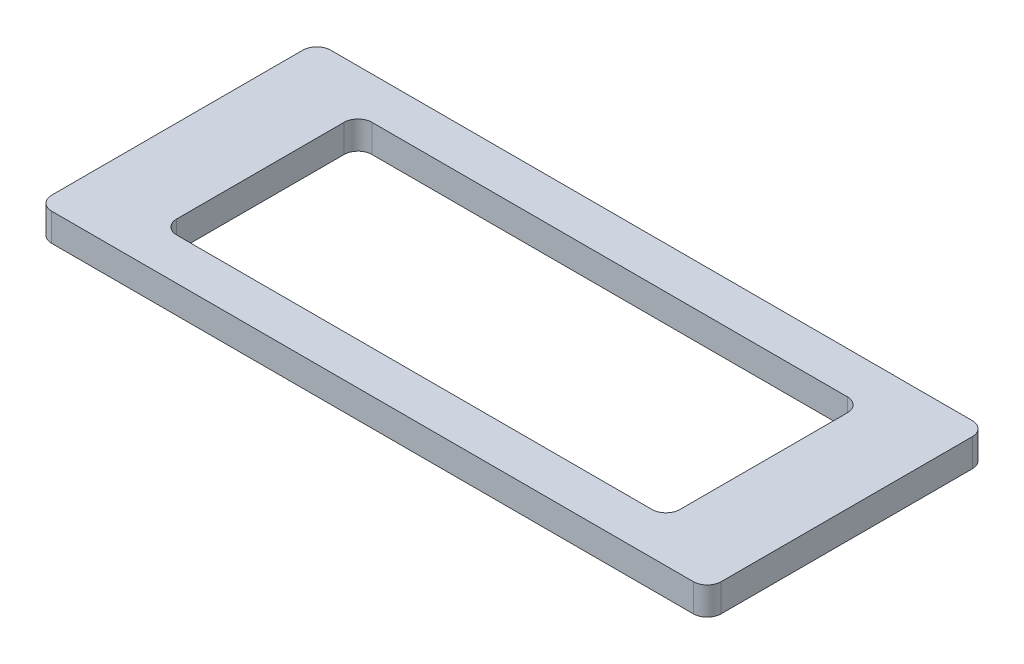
ISO-10303-21;
HEADER;
FILE_DESCRIPTION(('STEP AP214'),'2;1');
FILE_NAME('part.step','',(''),(''),'','','');
FILE_SCHEMA(('AUTOMOTIVE_DESIGN { 1 0 10303 214 1 1 1 1 }'));
ENDSEC;
DATA;
#1=APPLICATION_CONTEXT('core data for automotive mechanical design processes');
#2=APPLICATION_PROTOCOL_DEFINITION('international standard','automotive_design',2000,#1);
#3=PRODUCT_CONTEXT('',#1,'mechanical');
#4=PRODUCT('Part','Part','',(#3));
#5=PRODUCT_RELATED_PRODUCT_CATEGORY('part','',(#4));
#6=PRODUCT_DEFINITION_FORMATION('','',#4);
#7=PRODUCT_DEFINITION_CONTEXT('part definition',#1,'design');
#8=PRODUCT_DEFINITION('design','',#6,#7);
#9=PRODUCT_DEFINITION_SHAPE('','',#8);
#10=(LENGTH_UNIT() NAMED_UNIT(*) SI_UNIT(.MILLI.,.METRE.));
#11=(NAMED_UNIT(*) PLANE_ANGLE_UNIT() SI_UNIT($,.RADIAN.));
#12=(NAMED_UNIT(*) SI_UNIT($,.STERADIAN.) SOLID_ANGLE_UNIT());
#13=UNCERTAINTY_MEASURE_WITH_UNIT(LENGTH_MEASURE(1.E-05),#10,'distance_accuracy_value','');
#14=(GEOMETRIC_REPRESENTATION_CONTEXT(3) GLOBAL_UNCERTAINTY_ASSIGNED_CONTEXT((#13)) GLOBAL_UNIT_ASSIGNED_CONTEXT((#10,
#11,#12)) REPRESENTATION_CONTEXT('',''));
#15=CARTESIAN_POINT('',(0.,0.,0.));
#16=DIRECTION('',(0.,0.,1.));
#17=DIRECTION('',(1.,0.,0.));
#18=AXIS2_PLACEMENT_3D('',#15,#16,#17);
#19=CARTESIAN_POINT('',(-71.2820838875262,6.35,-53.975));
#20=DIRECTION('',(0.,0.,-1.));
#21=DIRECTION('',(-1.,0.,0.));
#22=AXIS2_PLACEMENT_3D('',#19,#20,#21);
#23=PLANE('',#22);
#24=DIRECTION('',(1.,0.,0.));
#25=VECTOR('',#24,1.);
#26=CARTESIAN_POINT('',(-71.2820838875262,0.,-53.975));
#27=LINE('',#26,#25);
#28=CARTESIAN_POINT('',(-15.748,0.,-53.975));
#29=VERTEX_POINT('',#28);
#30=CARTESIAN_POINT('',(130.302,0.,-53.975));
#31=VERTEX_POINT('',#30);
#32=EDGE_CURVE('E230',#29,#31,#27,.T.);
#33=ORIENTED_EDGE('',*,*,#32,.F.);
#34=DIRECTION('',(0.,-1.,0.));
#35=VECTOR('',#34,1.);
#36=CARTESIAN_POINT('',(-15.748,6.35,-53.975));
#37=LINE('',#36,#35);
#38=CARTESIAN_POINT('',(-15.748,6.35,-53.975));
#39=VERTEX_POINT('',#38);
#40=EDGE_CURVE('E11',#39,#29,#37,.T.);
#41=ORIENTED_EDGE('',*,*,#40,.F.);
#42=DIRECTION('',(1.,0.,0.));
#43=VECTOR('',#42,1.);
#44=CARTESIAN_POINT('',(-71.2820838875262,6.35,-53.975));
#45=LINE('',#44,#43);
#46=CARTESIAN_POINT('',(130.302,6.35,-53.975));
#47=VERTEX_POINT('',#46);
#48=EDGE_CURVE('E262',#39,#47,#45,.T.);
#49=ORIENTED_EDGE('',*,*,#48,.T.);
#50=DIRECTION('',(0.,-1.,0.));
#51=VECTOR('',#50,1.);
#52=CARTESIAN_POINT('',(130.302,6.35,-53.975));
#53=LINE('',#52,#51);
#54=EDGE_CURVE('E111',#47,#31,#53,.T.);
#55=ORIENTED_EDGE('',*,*,#54,.T.);
#56=EDGE_LOOP('',(#33,#41,#49,#55));
#57=FACE_BOUND('',#56,.T.);
#58=ADVANCED_FACE('F34',(#57),#23,.T.);
#59=CARTESIAN_POINT('',(-15.748,6.35,-50.8));
#60=DIRECTION('',(0.,-1.,0.));
#61=DIRECTION('',(0.,0.,-1.));
#62=AXIS2_PLACEMENT_3D('',#59,#60,#61);
#63=CYLINDRICAL_SURFACE('',#62,3.175);
#64=CARTESIAN_POINT('',(-15.748,0.,-50.8));
#65=DIRECTION('',(0.,1.,0.));
#66=DIRECTION('',(0.,0.,1.));
#67=AXIS2_PLACEMENT_3D('',#64,#65,#66);
#68=CIRCLE('',#67,3.175);
#69=CARTESIAN_POINT('',(-18.923,0.,-50.8));
#70=VERTEX_POINT('',#69);
#71=EDGE_CURVE('E227',#29,#70,#68,.T.);
#72=ORIENTED_EDGE('',*,*,#71,.T.);
#73=DIRECTION('',(0.,-1.,0.));
#74=VECTOR('',#73,1.);
#75=CARTESIAN_POINT('',(-18.923,6.35,-50.8));
#76=LINE('',#75,#74);
#77=CARTESIAN_POINT('',(-18.923,6.35,-50.8));
#78=VERTEX_POINT('',#77);
#79=EDGE_CURVE('E44',#78,#70,#76,.T.);
#80=ORIENTED_EDGE('',*,*,#79,.F.);
#81=CARTESIAN_POINT('',(-15.748,6.35,-50.8));
#82=DIRECTION('',(0.,1.,0.));
#83=DIRECTION('',(0.,0.,1.));
#84=AXIS2_PLACEMENT_3D('',#81,#82,#83);
#85=CIRCLE('',#84,3.175);
#86=EDGE_CURVE('E260',#39,#78,#85,.T.);
#87=ORIENTED_EDGE('',*,*,#86,.F.);
#88=ORIENTED_EDGE('',*,*,#40,.T.);
#89=EDGE_LOOP('',(#72,#80,#87,#88));
#90=FACE_BOUND('',#89,.T.);
#91=ADVANCED_FACE('F346',(#90),#63,.T.);
#92=CARTESIAN_POINT('',(-18.923,6.35,-22.225));
#93=DIRECTION('',(-1.,0.,0.));
#94=DIRECTION('',(0.,0.,1.));
#95=AXIS2_PLACEMENT_3D('',#92,#93,#94);
#96=PLANE('',#95);
#97=DIRECTION('',(0.,0.,-1.));
#98=VECTOR('',#97,1.);
#99=CARTESIAN_POINT('',(-18.923,0.,-22.225));
#100=LINE('',#99,#98);
#101=CARTESIAN_POINT('',(-18.923,0.,6.35));
#102=VERTEX_POINT('',#101);
#103=EDGE_CURVE('E224',#102,#70,#100,.T.);
#104=ORIENTED_EDGE('',*,*,#103,.F.);
#105=DIRECTION('',(0.,-1.,0.));
#106=VECTOR('',#105,1.);
#107=CARTESIAN_POINT('',(-18.923,6.35,6.35));
#108=LINE('',#107,#106);
#109=CARTESIAN_POINT('',(-18.923,6.35,6.35));
#110=VERTEX_POINT('',#109);
#111=EDGE_CURVE('E187',#110,#102,#108,.T.);
#112=ORIENTED_EDGE('',*,*,#111,.F.);
#113=DIRECTION('',(0.,0.,-1.));
#114=VECTOR('',#113,1.);
#115=CARTESIAN_POINT('',(-18.923,6.35,-22.225));
#116=LINE('',#115,#114);
#117=EDGE_CURVE('E257',#110,#78,#116,.T.);
#118=ORIENTED_EDGE('',*,*,#117,.T.);
#119=ORIENTED_EDGE('',*,*,#79,.T.);
#120=EDGE_LOOP('',(#104,#112,#118,#119));
#121=FACE_BOUND('',#120,.T.);
#122=ADVANCED_FACE('F352',(#121),#96,.T.);
#123=CARTESIAN_POINT('',(-15.748,6.35,6.35));
#124=DIRECTION('',(0.,-1.,0.));
#125=DIRECTION('',(0.,0.,-1.));
#126=AXIS2_PLACEMENT_3D('',#123,#124,#125);
#127=CYLINDRICAL_SURFACE('',#126,3.175);
#128=CARTESIAN_POINT('',(-15.748,0.,6.35));
#129=DIRECTION('',(0.,1.,0.));
#130=DIRECTION('',(0.,0.,1.));
#131=AXIS2_PLACEMENT_3D('',#128,#129,#130);
#132=CIRCLE('',#131,3.175);
#133=CARTESIAN_POINT('',(-15.748,0.,9.525));
#134=VERTEX_POINT('',#133);
#135=EDGE_CURVE('E221',#102,#134,#132,.T.);
#136=ORIENTED_EDGE('',*,*,#135,.T.);
#137=DIRECTION('',(0.,-1.,0.));
#138=VECTOR('',#137,1.);
#139=CARTESIAN_POINT('',(-15.748,6.35,9.525));
#140=LINE('',#139,#138);
#141=CARTESIAN_POINT('',(-15.748,6.35,9.525));
#142=VERTEX_POINT('',#141);
#143=EDGE_CURVE('E180',#142,#134,#140,.T.);
#144=ORIENTED_EDGE('',*,*,#143,.F.);
#145=CARTESIAN_POINT('',(-15.748,6.35,6.35));
#146=DIRECTION('',(0.,1.,0.));
#147=DIRECTION('',(0.,0.,1.));
#148=AXIS2_PLACEMENT_3D('',#145,#146,#147);
#149=CIRCLE('',#148,3.175);
#150=EDGE_CURVE('E255',#110,#142,#149,.T.);
#151=ORIENTED_EDGE('',*,*,#150,.F.);
#152=ORIENTED_EDGE('',*,*,#111,.T.);
#153=EDGE_LOOP('',(#136,#144,#151,#152));
#154=FACE_BOUND('',#153,.T.);
#155=ADVANCED_FACE('F355',(#154),#127,.T.);
#156=CARTESIAN_POINT('',(-71.2820838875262,6.35,9.525));
#157=DIRECTION('',(0.,0.,-1.));
#158=DIRECTION('',(-1.,0.,0.));
#159=AXIS2_PLACEMENT_3D('',#156,#157,#158);
#160=PLANE('',#159);
#161=DIRECTION('',(1.,0.,0.));
#162=VECTOR('',#161,1.);
#163=CARTESIAN_POINT('',(-71.2820838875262,0.,9.525));
#164=LINE('',#163,#162);
#165=CARTESIAN_POINT('',(130.302,0.,9.525));
#166=VERTEX_POINT('',#165);
#167=EDGE_CURVE('E218',#134,#166,#164,.T.);
#168=ORIENTED_EDGE('',*,*,#167,.T.);
#169=DIRECTION('',(0.,-1.,0.));
#170=VECTOR('',#169,1.);
#171=CARTESIAN_POINT('',(130.302,6.35,9.525));
#172=LINE('',#171,#170);
#173=CARTESIAN_POINT('',(130.302,6.35,9.525));
#174=VERTEX_POINT('',#173);
#175=EDGE_CURVE('E178',#174,#166,#172,.T.);
#176=ORIENTED_EDGE('',*,*,#175,.F.);
#177=DIRECTION('',(1.,0.,0.));
#178=VECTOR('',#177,1.);
#179=CARTESIAN_POINT('',(-71.2820838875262,6.35,9.525));
#180=LINE('',#179,#178);
#181=EDGE_CURVE('E171',#142,#174,#180,.T.);
#182=ORIENTED_EDGE('',*,*,#181,.F.);
#183=ORIENTED_EDGE('',*,*,#143,.T.);
#184=EDGE_LOOP('',(#168,#176,#182,#183));
#185=FACE_BOUND('',#184,.T.);
#186=ADVANCED_FACE('F357',(#185),#160,.F.);
#187=CARTESIAN_POINT('',(130.302,6.35,6.35));
#188=DIRECTION('',(0.,-1.,0.));
#189=DIRECTION('',(0.,0.,-1.));
#190=AXIS2_PLACEMENT_3D('',#187,#188,#189);
#191=CYLINDRICAL_SURFACE('',#190,3.17500000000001);
#192=CARTESIAN_POINT('',(130.302,0.,6.35));
#193=DIRECTION('',(0.,1.,0.));
#194=DIRECTION('',(0.,0.,1.));
#195=AXIS2_PLACEMENT_3D('',#192,#193,#194);
#196=CIRCLE('',#195,3.17500000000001);
#197=CARTESIAN_POINT('',(133.477,0.,6.35));
#198=VERTEX_POINT('',#197);
#199=EDGE_CURVE('E177',#166,#198,#196,.T.);
#200=ORIENTED_EDGE('',*,*,#199,.T.);
#201=DIRECTION('',(0.,-1.,0.));
#202=VECTOR('',#201,1.);
#203=CARTESIAN_POINT('',(133.477,6.35,6.35));
#204=LINE('',#203,#202);
#205=CARTESIAN_POINT('',(133.477,6.35,6.35));
#206=VERTEX_POINT('',#205);
#207=EDGE_CURVE('E163',#206,#198,#204,.T.);
#208=ORIENTED_EDGE('',*,*,#207,.F.);
#209=CARTESIAN_POINT('',(130.302,6.35,6.35));
#210=DIRECTION('',(0.,1.,0.));
#211=DIRECTION('',(0.,0.,1.));
#212=AXIS2_PLACEMENT_3D('',#209,#210,#211);
#213=CIRCLE('',#212,3.17500000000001);
#214=EDGE_CURVE('E166',#174,#206,#213,.T.);
#215=ORIENTED_EDGE('',*,*,#214,.F.);
#216=ORIENTED_EDGE('',*,*,#175,.T.);
#217=EDGE_LOOP('',(#200,#208,#215,#216));
#218=FACE_BOUND('',#217,.T.);
#219=ADVANCED_FACE('F176',(#218),#191,.T.);
#220=CARTESIAN_POINT('',(133.477,6.35,-22.225));
#221=DIRECTION('',(-1.,0.,0.));
#222=DIRECTION('',(0.,0.,1.));
#223=AXIS2_PLACEMENT_3D('',#220,#221,#222);
#224=PLANE('',#223);
#225=DIRECTION('',(0.,0.,-1.));
#226=VECTOR('',#225,1.);
#227=CARTESIAN_POINT('',(133.477,0.,-22.225));
#228=LINE('',#227,#226);
#229=CARTESIAN_POINT('',(133.477,0.,-50.8));
#230=VERTEX_POINT('',#229);
#231=EDGE_CURVE('E215',#198,#230,#228,.T.);
#232=ORIENTED_EDGE('',*,*,#231,.T.);
#233=DIRECTION('',(0.,-1.,0.));
#234=VECTOR('',#233,1.);
#235=CARTESIAN_POINT('',(133.477,6.35,-50.8));
#236=LINE('',#235,#234);
#237=CARTESIAN_POINT('',(133.477,6.35,-50.8));
#238=VERTEX_POINT('',#237);
#239=EDGE_CURVE('E165',#238,#230,#236,.T.);
#240=ORIENTED_EDGE('',*,*,#239,.F.);
#241=DIRECTION('',(0.,0.,-1.));
#242=VECTOR('',#241,1.);
#243=CARTESIAN_POINT('',(133.477,6.35,-22.225));
#244=LINE('',#243,#242);
#245=EDGE_CURVE('E158',#206,#238,#244,.T.);
#246=ORIENTED_EDGE('',*,*,#245,.F.);
#247=ORIENTED_EDGE('',*,*,#207,.T.);
#248=EDGE_LOOP('',(#232,#240,#246,#247));
#249=FACE_BOUND('',#248,.T.);
#250=ADVANCED_FACE('F161',(#249),#224,.F.);
#251=CARTESIAN_POINT('',(-71.2820838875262,6.35,0.));
#252=DIRECTION('',(0.,0.,-1.));
#253=DIRECTION('',(-1.,0.,0.));
#254=AXIS2_PLACEMENT_3D('',#251,#252,#253);
#255=PLANE('',#254);
#256=DIRECTION('',(1.,0.,0.));
#257=VECTOR('',#256,1.);
#258=CARTESIAN_POINT('',(-71.2820838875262,0.,0.));
#259=LINE('',#258,#257);
#260=CARTESIAN_POINT('',(3.17500000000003,0.,0.));
#261=VERTEX_POINT('',#260);
#262=CARTESIAN_POINT('',(111.379,0.,0.));
#263=VERTEX_POINT('',#262);
#264=EDGE_CURVE('E249',#261,#263,#259,.T.);
#265=ORIENTED_EDGE('',*,*,#264,.F.);
#266=DIRECTION('',(0.,-1.,0.));
#267=VECTOR('',#266,1.);
#268=CARTESIAN_POINT('',(3.17500000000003,6.35,0.));
#269=LINE('',#268,#267);
#270=CARTESIAN_POINT('',(3.17500000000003,6.35,0.));
#271=VERTEX_POINT('',#270);
#272=EDGE_CURVE('E38',#271,#261,#269,.T.);
#273=ORIENTED_EDGE('',*,*,#272,.F.);
#274=DIRECTION('',(1.,0.,0.));
#275=VECTOR('',#274,1.);
#276=CARTESIAN_POINT('',(-71.2820838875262,6.35,0.));
#277=LINE('',#276,#275);
#278=CARTESIAN_POINT('',(111.379,6.35,0.));
#279=VERTEX_POINT('',#278);
#280=EDGE_CURVE('E214',#271,#279,#277,.T.);
#281=ORIENTED_EDGE('',*,*,#280,.T.);
#282=DIRECTION('',(0.,-1.,0.));
#283=VECTOR('',#282,1.);
#284=CARTESIAN_POINT('',(111.379,6.35,0.));
#285=LINE('',#284,#283);
#286=EDGE_CURVE('E190',#279,#263,#285,.T.);
#287=ORIENTED_EDGE('',*,*,#286,.T.);
#288=EDGE_LOOP('',(#265,#273,#281,#287));
#289=FACE_BOUND('',#288,.T.);
#290=ADVANCED_FACE('F36',(#289),#255,.T.);
#291=CARTESIAN_POINT('',(3.175,6.35,-3.175));
#292=DIRECTION('',(0.,-1.,0.));
#293=DIRECTION('',(0.,0.,-1.));
#294=AXIS2_PLACEMENT_3D('',#291,#292,#293);
#295=CYLINDRICAL_SURFACE('',#294,3.175);
#296=CARTESIAN_POINT('',(3.175,0.,-3.175));
#297=DIRECTION('',(0.,1.,0.));
#298=DIRECTION('',(0.,0.,1.));
#299=AXIS2_PLACEMENT_3D('',#296,#297,#298);
#300=CIRCLE('',#299,3.175);
#301=CARTESIAN_POINT('',(0.,0.,-3.17500000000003));
#302=VERTEX_POINT('',#301);
#303=EDGE_CURVE('E247',#261,#302,#300,.F.);
#304=ORIENTED_EDGE('',*,*,#303,.T.);
#305=DIRECTION('',(0.,-1.,0.));
#306=VECTOR('',#305,1.);
#307=CARTESIAN_POINT('',(0.,6.35,-3.17500000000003));
#308=LINE('',#307,#306);
#309=CARTESIAN_POINT('',(0.,6.35,-3.17500000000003));
#310=VERTEX_POINT('',#309);
#311=EDGE_CURVE('E204',#310,#302,#308,.T.);
#312=ORIENTED_EDGE('',*,*,#311,.F.);
#313=CARTESIAN_POINT('',(3.175,6.35,-3.175));
#314=DIRECTION('',(0.,1.,0.));
#315=DIRECTION('',(0.,0.,1.));
#316=AXIS2_PLACEMENT_3D('',#313,#314,#315);
#317=CIRCLE('',#316,3.175);
#318=EDGE_CURVE('E278',#271,#310,#317,.F.);
#319=ORIENTED_EDGE('',*,*,#318,.F.);
#320=ORIENTED_EDGE('',*,*,#272,.T.);
#321=EDGE_LOOP('',(#304,#312,#319,#320));
#322=FACE_BOUND('',#321,.T.);
#323=ADVANCED_FACE('F397',(#322),#295,.F.);
#324=CARTESIAN_POINT('',(0.,6.35,-22.225));
#325=DIRECTION('',(-1.,0.,0.));
#326=DIRECTION('',(0.,0.,1.));
#327=AXIS2_PLACEMENT_3D('',#324,#325,#326);
#328=PLANE('',#327);
#329=DIRECTION('',(0.,0.,-1.));
#330=VECTOR('',#329,1.);
#331=CARTESIAN_POINT('',(0.,0.,-22.225));
#332=LINE('',#331,#330);
#333=CARTESIAN_POINT('',(0.,0.,-41.275));
#334=VERTEX_POINT('',#333);
#335=EDGE_CURVE('E245',#302,#334,#332,.T.);
#336=ORIENTED_EDGE('',*,*,#335,.T.);
#337=DIRECTION('',(0.,-1.,0.));
#338=VECTOR('',#337,1.);
#339=CARTESIAN_POINT('',(0.,6.35,-41.275));
#340=LINE('',#339,#338);
#341=CARTESIAN_POINT('',(0.,6.35,-41.275));
#342=VERTEX_POINT('',#341);
#343=EDGE_CURVE('E202',#342,#334,#340,.T.);
#344=ORIENTED_EDGE('',*,*,#343,.F.);
#345=DIRECTION('',(0.,0.,-1.));
#346=VECTOR('',#345,1.);
#347=CARTESIAN_POINT('',(0.,6.35,-22.225));
#348=LINE('',#347,#346);
#349=EDGE_CURVE('E276',#310,#342,#348,.T.);
#350=ORIENTED_EDGE('',*,*,#349,.F.);
#351=ORIENTED_EDGE('',*,*,#311,.T.);
#352=EDGE_LOOP('',(#336,#344,#350,#351));
#353=FACE_BOUND('',#352,.T.);
#354=ADVANCED_FACE('F394',(#353),#328,.F.);
#355=CARTESIAN_POINT('',(3.175,6.35,-41.275));
#356=DIRECTION('',(0.,-1.,0.));
#357=DIRECTION('',(0.,0.,-1.));
#358=AXIS2_PLACEMENT_3D('',#355,#356,#357);
#359=CYLINDRICAL_SURFACE('',#358,3.175);
#360=CARTESIAN_POINT('',(3.175,0.,-41.275));
#361=DIRECTION('',(0.,1.,0.));
#362=DIRECTION('',(0.,0.,1.));
#363=AXIS2_PLACEMENT_3D('',#360,#361,#362);
#364=CIRCLE('',#363,3.175);
#365=CARTESIAN_POINT('',(3.17500000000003,0.,-44.45));
#366=VERTEX_POINT('',#365);
#367=EDGE_CURVE('E243',#334,#366,#364,.F.);
#368=ORIENTED_EDGE('',*,*,#367,.T.);
#369=DIRECTION('',(0.,-1.,0.));
#370=VECTOR('',#369,1.);
#371=CARTESIAN_POINT('',(3.17500000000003,6.35,-44.45));
#372=LINE('',#371,#370);
#373=CARTESIAN_POINT('',(3.17500000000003,6.35,-44.45));
#374=VERTEX_POINT('',#373);
#375=EDGE_CURVE('E199',#374,#366,#372,.T.);
#376=ORIENTED_EDGE('',*,*,#375,.F.);
#377=CARTESIAN_POINT('',(3.175,6.35,-41.275));
#378=DIRECTION('',(0.,1.,0.));
#379=DIRECTION('',(0.,0.,1.));
#380=AXIS2_PLACEMENT_3D('',#377,#378,#379);
#381=CIRCLE('',#380,3.175);
#382=EDGE_CURVE('E274',#342,#374,#381,.F.);
#383=ORIENTED_EDGE('',*,*,#382,.F.);
#384=ORIENTED_EDGE('',*,*,#343,.T.);
#385=EDGE_LOOP('',(#368,#376,#383,#384));
#386=FACE_BOUND('',#385,.T.);
#387=ADVANCED_FACE('F390',(#386),#359,.F.);
#388=CARTESIAN_POINT('',(-71.2820838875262,6.35,-44.45));
#389=DIRECTION('',(0.,0.,-1.));
#390=DIRECTION('',(-1.,0.,0.));
#391=AXIS2_PLACEMENT_3D('',#388,#389,#390);
#392=PLANE('',#391);
#393=DIRECTION('',(1.,0.,0.));
#394=VECTOR('',#393,1.);
#395=CARTESIAN_POINT('',(-71.2820838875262,0.,-44.45));
#396=LINE('',#395,#394);
#397=CARTESIAN_POINT('',(111.379,0.,-44.45));
#398=VERTEX_POINT('',#397);
#399=EDGE_CURVE('E241',#366,#398,#396,.T.);
#400=ORIENTED_EDGE('',*,*,#399,.T.);
#401=DIRECTION('',(0.,-1.,0.));
#402=VECTOR('',#401,1.);
#403=CARTESIAN_POINT('',(111.379,6.35,-44.45));
#404=LINE('',#403,#402);
#405=CARTESIAN_POINT('',(111.379,6.35,-44.45));
#406=VERTEX_POINT('',#405);
#407=EDGE_CURVE('E196',#406,#398,#404,.T.);
#408=ORIENTED_EDGE('',*,*,#407,.F.);
#409=DIRECTION('',(1.,0.,0.));
#410=VECTOR('',#409,1.);
#411=CARTESIAN_POINT('',(-71.2820838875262,6.35,-44.45));
#412=LINE('',#411,#410);
#413=EDGE_CURVE('E272',#374,#406,#412,.T.);
#414=ORIENTED_EDGE('',*,*,#413,.F.);
#415=ORIENTED_EDGE('',*,*,#375,.T.);
#416=EDGE_LOOP('',(#400,#408,#414,#415));
#417=FACE_BOUND('',#416,.T.);
#418=ADVANCED_FACE('F386',(#417),#392,.F.);
#419=CARTESIAN_POINT('',(111.379,6.35,-41.275));
#420=DIRECTION('',(0.,-1.,0.));
#421=DIRECTION('',(0.,0.,-1.));
#422=AXIS2_PLACEMENT_3D('',#419,#420,#421);
#423=CYLINDRICAL_SURFACE('',#422,3.175);
#424=CARTESIAN_POINT('',(111.379,0.,-41.275));
#425=DIRECTION('',(0.,1.,0.));
#426=DIRECTION('',(0.,0.,1.));
#427=AXIS2_PLACEMENT_3D('',#424,#425,#426);
#428=CIRCLE('',#427,3.175);
#429=CARTESIAN_POINT('',(114.554,0.,-41.275));
#430=VERTEX_POINT('',#429);
#431=EDGE_CURVE('E238',#398,#430,#428,.F.);
#432=ORIENTED_EDGE('',*,*,#431,.T.);
#433=DIRECTION('',(0.,-1.,0.));
#434=VECTOR('',#433,1.);
#435=CARTESIAN_POINT('',(114.554,6.35,-41.275));
#436=LINE('',#435,#434);
#437=CARTESIAN_POINT('',(114.554,6.35,-41.275));
#438=VERTEX_POINT('',#437);
#439=EDGE_CURVE('E194',#438,#430,#436,.T.);
#440=ORIENTED_EDGE('',*,*,#439,.F.);
#441=CARTESIAN_POINT('',(111.379,6.35,-41.275));
#442=DIRECTION('',(0.,1.,0.));
#443=DIRECTION('',(0.,0.,1.));
#444=AXIS2_PLACEMENT_3D('',#441,#442,#443);
#445=CIRCLE('',#444,3.175);
#446=EDGE_CURVE('E270',#406,#438,#445,.F.);
#447=ORIENTED_EDGE('',*,*,#446,.F.);
#448=ORIENTED_EDGE('',*,*,#407,.T.);
#449=EDGE_LOOP('',(#432,#440,#447,#448));
#450=FACE_BOUND('',#449,.T.);
#451=ADVANCED_FACE('F382',(#450),#423,.F.);
#452=CARTESIAN_POINT('',(114.554,6.35,-22.225));
#453=DIRECTION('',(-1.,0.,0.));
#454=DIRECTION('',(0.,0.,1.));
#455=AXIS2_PLACEMENT_3D('',#452,#453,#454);
#456=PLANE('',#455);
#457=DIRECTION('',(0.,0.,-1.));
#458=VECTOR('',#457,1.);
#459=CARTESIAN_POINT('',(114.554,0.,-22.225));
#460=LINE('',#459,#458);
#461=CARTESIAN_POINT('',(114.554,0.,-3.175));
#462=VERTEX_POINT('',#461);
#463=EDGE_CURVE('E235',#462,#430,#460,.T.);
#464=ORIENTED_EDGE('',*,*,#463,.F.);
#465=DIRECTION('',(0.,-1.,0.));
#466=VECTOR('',#465,1.);
#467=CARTESIAN_POINT('',(114.554,6.35,-3.175));
#468=LINE('',#467,#466);
#469=CARTESIAN_POINT('',(114.554,6.35,-3.175));
#470=VERTEX_POINT('',#469);
#471=EDGE_CURVE('E192',#470,#462,#468,.T.);
#472=ORIENTED_EDGE('',*,*,#471,.F.);
#473=DIRECTION('',(0.,0.,-1.));
#474=VECTOR('',#473,1.);
#475=CARTESIAN_POINT('',(114.554,6.35,-22.225));
#476=LINE('',#475,#474);
#477=EDGE_CURVE('E267',#470,#438,#476,.T.);
#478=ORIENTED_EDGE('',*,*,#477,.T.);
#479=ORIENTED_EDGE('',*,*,#439,.T.);
#480=EDGE_LOOP('',(#464,#472,#478,#479));
#481=FACE_BOUND('',#480,.T.);
#482=ADVANCED_FACE('F378',(#481),#456,.T.);
#483=CARTESIAN_POINT('',(111.379,6.35,-3.175));
#484=DIRECTION('',(0.,-1.,0.));
#485=DIRECTION('',(0.,0.,-1.));
#486=AXIS2_PLACEMENT_3D('',#483,#484,#485);
#487=CYLINDRICAL_SURFACE('',#486,3.175);
#488=CARTESIAN_POINT('',(111.379,0.,-3.175));
#489=DIRECTION('',(0.,1.,0.));
#490=DIRECTION('',(0.,0.,1.));
#491=AXIS2_PLACEMENT_3D('',#488,#489,#490);
#492=CIRCLE('',#491,3.175);
#493=EDGE_CURVE('E232',#263,#462,#492,.T.);
#494=ORIENTED_EDGE('',*,*,#493,.F.);
#495=ORIENTED_EDGE('',*,*,#286,.F.);
#496=CARTESIAN_POINT('',(111.379,6.35,-3.175));
#497=DIRECTION('',(0.,1.,0.));
#498=DIRECTION('',(0.,0.,1.));
#499=AXIS2_PLACEMENT_3D('',#496,#497,#498);
#500=CIRCLE('',#499,3.175);
#501=EDGE_CURVE('E264',#279,#470,#500,.T.);
#502=ORIENTED_EDGE('',*,*,#501,.T.);
#503=ORIENTED_EDGE('',*,*,#471,.T.);
#504=EDGE_LOOP('',(#494,#495,#502,#503));
#505=FACE_BOUND('',#504,.T.);
#506=ADVANCED_FACE('F374',(#505),#487,.F.);
#507=CARTESIAN_POINT('',(130.302,6.35,-50.8));
#508=DIRECTION('',(0.,-1.,0.));
#509=DIRECTION('',(0.,0.,-1.));
#510=AXIS2_PLACEMENT_3D('',#507,#508,#509);
#511=CYLINDRICAL_SURFACE('',#510,3.175);
#512=CARTESIAN_POINT('',(130.302,0.,-50.8));
#513=DIRECTION('',(0.,1.,0.));
#514=DIRECTION('',(0.,0.,1.));
#515=AXIS2_PLACEMENT_3D('',#512,#513,#514);
#516=CIRCLE('',#515,3.175);
#517=EDGE_CURVE('E104',#230,#31,#516,.T.);
#518=ORIENTED_EDGE('',*,*,#517,.T.);
#519=ORIENTED_EDGE('',*,*,#54,.F.);
#520=CARTESIAN_POINT('',(130.302,6.35,-50.8));
#521=DIRECTION('',(0.,1.,0.));
#522=DIRECTION('',(0.,0.,1.));
#523=AXIS2_PLACEMENT_3D('',#520,#521,#522);
#524=CIRCLE('',#523,3.175);
#525=EDGE_CURVE('E53',#238,#47,#524,.T.);
#526=ORIENTED_EDGE('',*,*,#525,.F.);
#527=ORIENTED_EDGE('',*,*,#239,.T.);
#528=EDGE_LOOP('',(#518,#519,#526,#527));
#529=FACE_BOUND('',#528,.T.);
#530=ADVANCED_FACE('F377',(#529),#511,.T.);
#531=CARTESIAN_POINT('',(-71.2820838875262,6.35,-22.225));
#532=DIRECTION('',(0.,1.,0.));
#533=DIRECTION('',(0.,0.,1.));
#534=AXIS2_PLACEMENT_3D('',#531,#532,#533);
#535=PLANE('',#534);
#536=ORIENTED_EDGE('',*,*,#280,.F.);
#537=ORIENTED_EDGE('',*,*,#318,.T.);
#538=ORIENTED_EDGE('',*,*,#349,.T.);
#539=ORIENTED_EDGE('',*,*,#382,.T.);
#540=ORIENTED_EDGE('',*,*,#413,.T.);
#541=ORIENTED_EDGE('',*,*,#446,.T.);
#542=ORIENTED_EDGE('',*,*,#477,.F.);
#543=ORIENTED_EDGE('',*,*,#501,.F.);
#544=EDGE_LOOP('',(#536,#537,#538,#539,#540,#541,#542,#543));
#545=FACE_BOUND('',#544,.T.);
#546=ORIENTED_EDGE('',*,*,#48,.F.);
#547=ORIENTED_EDGE('',*,*,#86,.T.);
#548=ORIENTED_EDGE('',*,*,#117,.F.);
#549=ORIENTED_EDGE('',*,*,#150,.T.);
#550=ORIENTED_EDGE('',*,*,#181,.T.);
#551=ORIENTED_EDGE('',*,*,#214,.T.);
#552=ORIENTED_EDGE('',*,*,#245,.T.);
#553=ORIENTED_EDGE('',*,*,#525,.T.);
#554=EDGE_LOOP('',(#546,#547,#548,#549,#550,#551,#552,#553));
#555=FACE_BOUND('',#554,.T.);
#556=ADVANCED_FACE('F169',(#545,#555),#535,.T.);
#557=CARTESIAN_POINT('',(-71.2820838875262,0.,-22.225));
#558=DIRECTION('',(0.,1.,0.));
#559=DIRECTION('',(0.,0.,1.));
#560=AXIS2_PLACEMENT_3D('',#557,#558,#559);
#561=PLANE('',#560);
#562=CARTESIAN_POINT('',(11.6833274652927,0.,3.17500000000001));
#563=DIRECTION('',(0.,-1.,0.));
#564=DIRECTION('',(0.,0.,-1.));
#565=AXIS2_PLACEMENT_3D('',#562,#563,#564);
#566=CIRCLE('',#565,1.651);
#567=CARTESIAN_POINT('',(11.6833274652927,0.,1.52400000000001));
#568=VERTEX_POINT('',#567);
#569=EDGE_CURVE('E311',#568,#568,#566,.T.);
#570=ORIENTED_EDGE('',*,*,#569,.F.);
#571=EDGE_LOOP('',(#570));
#572=FACE_BOUND('',#571,.T.);
#573=CARTESIAN_POINT('',(57.4033274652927,0.,3.17500000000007));
#574=DIRECTION('',(0.,-1.,0.));
#575=DIRECTION('',(0.,0.,-1.));
#576=AXIS2_PLACEMENT_3D('',#573,#574,#575);
#577=CIRCLE('',#576,1.65100000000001);
#578=CARTESIAN_POINT('',(57.4033274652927,0.,1.52400000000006));
#579=VERTEX_POINT('',#578);
#580=EDGE_CURVE('E305',#579,#579,#577,.T.);
#581=ORIENTED_EDGE('',*,*,#580,.F.);
#582=EDGE_LOOP('',(#581));
#583=FACE_BOUND('',#582,.T.);
#584=CARTESIAN_POINT('',(103.123327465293,0.,3.17500000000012));
#585=DIRECTION('',(0.,-1.,0.));
#586=DIRECTION('',(0.,0.,-1.));
#587=AXIS2_PLACEMENT_3D('',#584,#585,#586);
#588=CIRCLE('',#587,1.65100000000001);
#589=CARTESIAN_POINT('',(103.123327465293,0.,1.52400000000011));
#590=VERTEX_POINT('',#589);
#591=EDGE_CURVE('E299',#590,#590,#588,.T.);
#592=ORIENTED_EDGE('',*,*,#591,.F.);
#593=EDGE_LOOP('',(#592));
#594=FACE_BOUND('',#593,.T.);
#595=CARTESIAN_POINT('',(11.6833274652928,0.,-47.625));
#596=DIRECTION('',(0.,-1.,0.));
#597=DIRECTION('',(0.,0.,-1.));
#598=AXIS2_PLACEMENT_3D('',#595,#596,#597);
#599=CIRCLE('',#598,1.65100000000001);
#600=CARTESIAN_POINT('',(11.6833274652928,0.,-49.276));
#601=VERTEX_POINT('',#600);
#602=EDGE_CURVE('E293',#601,#601,#599,.T.);
#603=ORIENTED_EDGE('',*,*,#602,.F.);
#604=EDGE_LOOP('',(#603));
#605=FACE_BOUND('',#604,.T.);
#606=CARTESIAN_POINT('',(57.4033274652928,0.,-47.6249999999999));
#607=DIRECTION('',(0.,-1.,0.));
#608=DIRECTION('',(0.,0.,-1.));
#609=AXIS2_PLACEMENT_3D('',#606,#607,#608);
#610=CIRCLE('',#609,1.65100000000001);
#611=CARTESIAN_POINT('',(57.4033274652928,0.,-49.2759999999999));
#612=VERTEX_POINT('',#611);
#613=EDGE_CURVE('E287',#612,#612,#610,.T.);
#614=ORIENTED_EDGE('',*,*,#613,.F.);
#615=EDGE_LOOP('',(#614));
#616=FACE_BOUND('',#615,.T.);
#617=CARTESIAN_POINT('',(103.123327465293,0.,-47.6249999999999));
#618=DIRECTION('',(0.,-1.,0.));
#619=DIRECTION('',(0.,0.,-1.));
#620=AXIS2_PLACEMENT_3D('',#617,#618,#619);
#621=CIRCLE('',#620,1.65100000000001);
#622=CARTESIAN_POINT('',(103.123327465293,0.,-49.2759999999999));
#623=VERTEX_POINT('',#622);
#624=EDGE_CURVE('E281',#623,#623,#621,.T.);
#625=ORIENTED_EDGE('',*,*,#624,.F.);
#626=EDGE_LOOP('',(#625));
#627=FACE_BOUND('',#626,.T.);
#628=ORIENTED_EDGE('',*,*,#264,.T.);
#629=ORIENTED_EDGE('',*,*,#493,.T.);
#630=ORIENTED_EDGE('',*,*,#463,.T.);
#631=ORIENTED_EDGE('',*,*,#431,.F.);
#632=ORIENTED_EDGE('',*,*,#399,.F.);
#633=ORIENTED_EDGE('',*,*,#367,.F.);
#634=ORIENTED_EDGE('',*,*,#335,.F.);
#635=ORIENTED_EDGE('',*,*,#303,.F.);
#636=EDGE_LOOP('',(#628,#629,#630,#631,#632,#633,#634,#635));
#637=FACE_BOUND('',#636,.T.);
#638=ORIENTED_EDGE('',*,*,#32,.T.);
#639=ORIENTED_EDGE('',*,*,#517,.F.);
#640=ORIENTED_EDGE('',*,*,#231,.F.);
#641=ORIENTED_EDGE('',*,*,#199,.F.);
#642=ORIENTED_EDGE('',*,*,#167,.F.);
#643=ORIENTED_EDGE('',*,*,#135,.F.);
#644=ORIENTED_EDGE('',*,*,#103,.T.);
#645=ORIENTED_EDGE('',*,*,#71,.F.);
#646=EDGE_LOOP('',(#638,#639,#640,#641,#642,#643,#644,#645));
#647=FACE_BOUND('',#646,.T.);
#648=ADVANCED_FACE('F326',(#572,#583,#594,#605,#616,#627,#637,#647),#561,.F.);
#649=CARTESIAN_POINT('',(103.123327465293,1.5875,-47.6249999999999));
#650=DIRECTION('',(0.,-1.,0.));
#651=DIRECTION('',(0.,0.,-1.));
#652=AXIS2_PLACEMENT_3D('',#649,#650,#651);
#653=CYLINDRICAL_SURFACE('',#652,1.65100000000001);
#654=CARTESIAN_POINT('',(103.123327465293,1.5875,-47.6249999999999));
#655=DIRECTION('',(0.,-1.,0.));
#656=DIRECTION('',(0.,0.,-1.));
#657=AXIS2_PLACEMENT_3D('',#654,#655,#656);
#658=CIRCLE('',#657,1.65100000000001);
#659=CARTESIAN_POINT('',(103.123327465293,1.5875,-49.2759999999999));
#660=VERTEX_POINT('',#659);
#661=EDGE_CURVE('E252',#660,#660,#658,.T.);
#662=ORIENTED_EDGE('',*,*,#661,.F.);
#663=EDGE_LOOP('',(#662));
#664=FACE_BOUND('',#663,.T.);
#665=ORIENTED_EDGE('',*,*,#624,.T.);
#666=EDGE_LOOP('',(#665));
#667=FACE_BOUND('',#666,.T.);
#668=ADVANCED_FACE('F329',(#664,#667),#653,.F.);
#669=CARTESIAN_POINT('',(103.123327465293,1.5875,-47.6249999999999));
#670=DIRECTION('',(0.,-1.,0.));
#671=DIRECTION('',(0.,0.,-1.));
#672=AXIS2_PLACEMENT_3D('',#669,#670,#671);
#673=PLANE('',#672);
#674=ORIENTED_EDGE('',*,*,#661,.T.);
#675=EDGE_LOOP('',(#674));
#676=FACE_BOUND('',#675,.T.);
#677=ADVANCED_FACE('F501',(#676),#673,.T.);
#678=CARTESIAN_POINT('',(57.4033274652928,1.5875,-47.6249999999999));
#679=DIRECTION('',(0.,-1.,0.));
#680=DIRECTION('',(0.,0.,-1.));
#681=AXIS2_PLACEMENT_3D('',#678,#679,#680);
#682=CYLINDRICAL_SURFACE('',#681,1.65100000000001);
#683=CARTESIAN_POINT('',(57.4033274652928,1.5875,-47.6249999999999));
#684=DIRECTION('',(0.,-1.,0.));
#685=DIRECTION('',(0.,0.,-1.));
#686=AXIS2_PLACEMENT_3D('',#683,#684,#685);
#687=CIRCLE('',#686,1.65100000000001);
#688=CARTESIAN_POINT('',(57.4033274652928,1.5875,-49.2759999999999));
#689=VERTEX_POINT('',#688);
#690=EDGE_CURVE('E284',#689,#689,#687,.T.);
#691=ORIENTED_EDGE('',*,*,#690,.F.);
#692=EDGE_LOOP('',(#691));
#693=FACE_BOUND('',#692,.T.);
#694=ORIENTED_EDGE('',*,*,#613,.T.);
#695=EDGE_LOOP('',(#694));
#696=FACE_BOUND('',#695,.T.);
#697=ADVANCED_FACE('F510',(#693,#696),#682,.F.);
#698=CARTESIAN_POINT('',(57.4033274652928,1.5875,-47.6249999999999));
#699=DIRECTION('',(0.,-1.,0.));
#700=DIRECTION('',(0.,0.,-1.));
#701=AXIS2_PLACEMENT_3D('',#698,#699,#700);
#702=PLANE('',#701);
#703=ORIENTED_EDGE('',*,*,#690,.T.);
#704=EDGE_LOOP('',(#703));
#705=FACE_BOUND('',#704,.T.);
#706=ADVANCED_FACE('F519',(#705),#702,.T.);
#707=CARTESIAN_POINT('',(11.6833274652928,1.5875,-47.625));
#708=DIRECTION('',(0.,-1.,0.));
#709=DIRECTION('',(0.,0.,-1.));
#710=AXIS2_PLACEMENT_3D('',#707,#708,#709);
#711=CYLINDRICAL_SURFACE('',#710,1.65100000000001);
#712=CARTESIAN_POINT('',(11.6833274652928,1.5875,-47.625));
#713=DIRECTION('',(0.,-1.,0.));
#714=DIRECTION('',(0.,0.,-1.));
#715=AXIS2_PLACEMENT_3D('',#712,#713,#714);
#716=CIRCLE('',#715,1.65100000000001);
#717=CARTESIAN_POINT('',(11.6833274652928,1.5875,-49.276));
#718=VERTEX_POINT('',#717);
#719=EDGE_CURVE('E290',#718,#718,#716,.T.);
#720=ORIENTED_EDGE('',*,*,#719,.F.);
#721=EDGE_LOOP('',(#720));
#722=FACE_BOUND('',#721,.T.);
#723=ORIENTED_EDGE('',*,*,#602,.T.);
#724=EDGE_LOOP('',(#723));
#725=FACE_BOUND('',#724,.T.);
#726=ADVANCED_FACE('F529',(#722,#725),#711,.F.);
#727=CARTESIAN_POINT('',(11.6833274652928,1.5875,-47.625));
#728=DIRECTION('',(0.,-1.,0.));
#729=DIRECTION('',(0.,0.,-1.));
#730=AXIS2_PLACEMENT_3D('',#727,#728,#729);
#731=PLANE('',#730);
#732=ORIENTED_EDGE('',*,*,#719,.T.);
#733=EDGE_LOOP('',(#732));
#734=FACE_BOUND('',#733,.T.);
#735=ADVANCED_FACE('F539',(#734),#731,.T.);
#736=CARTESIAN_POINT('',(103.123327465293,1.5875,3.17500000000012));
#737=DIRECTION('',(0.,-1.,0.));
#738=DIRECTION('',(0.,0.,-1.));
#739=AXIS2_PLACEMENT_3D('',#736,#737,#738);
#740=CYLINDRICAL_SURFACE('',#739,1.65100000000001);
#741=CARTESIAN_POINT('',(103.123327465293,1.5875,3.17500000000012));
#742=DIRECTION('',(0.,-1.,0.));
#743=DIRECTION('',(0.,0.,-1.));
#744=AXIS2_PLACEMENT_3D('',#741,#742,#743);
#745=CIRCLE('',#744,1.65100000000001);
#746=CARTESIAN_POINT('',(103.123327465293,1.5875,1.52400000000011));
#747=VERTEX_POINT('',#746);
#748=EDGE_CURVE('E296',#747,#747,#745,.T.);
#749=ORIENTED_EDGE('',*,*,#748,.F.);
#750=EDGE_LOOP('',(#749));
#751=FACE_BOUND('',#750,.T.);
#752=ORIENTED_EDGE('',*,*,#591,.T.);
#753=EDGE_LOOP('',(#752));
#754=FACE_BOUND('',#753,.T.);
#755=ADVANCED_FACE('F549',(#751,#754),#740,.F.);
#756=CARTESIAN_POINT('',(103.123327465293,1.5875,3.17500000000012));
#757=DIRECTION('',(0.,-1.,0.));
#758=DIRECTION('',(0.,0.,-1.));
#759=AXIS2_PLACEMENT_3D('',#756,#757,#758);
#760=PLANE('',#759);
#761=ORIENTED_EDGE('',*,*,#748,.T.);
#762=EDGE_LOOP('',(#761));
#763=FACE_BOUND('',#762,.T.);
#764=ADVANCED_FACE('F559',(#763),#760,.T.);
#765=CARTESIAN_POINT('',(57.4033274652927,1.5875,3.17500000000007));
#766=DIRECTION('',(0.,-1.,0.));
#767=DIRECTION('',(0.,0.,-1.));
#768=AXIS2_PLACEMENT_3D('',#765,#766,#767);
#769=CYLINDRICAL_SURFACE('',#768,1.65100000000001);
#770=CARTESIAN_POINT('',(57.4033274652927,1.5875,3.17500000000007));
#771=DIRECTION('',(0.,-1.,0.));
#772=DIRECTION('',(0.,0.,-1.));
#773=AXIS2_PLACEMENT_3D('',#770,#771,#772);
#774=CIRCLE('',#773,1.65100000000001);
#775=CARTESIAN_POINT('',(57.4033274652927,1.5875,1.52400000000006));
#776=VERTEX_POINT('',#775);
#777=EDGE_CURVE('E302',#776,#776,#774,.T.);
#778=ORIENTED_EDGE('',*,*,#777,.F.);
#779=EDGE_LOOP('',(#778));
#780=FACE_BOUND('',#779,.T.);
#781=ORIENTED_EDGE('',*,*,#580,.T.);
#782=EDGE_LOOP('',(#781));
#783=FACE_BOUND('',#782,.T.);
#784=ADVANCED_FACE('F569',(#780,#783),#769,.F.);
#785=CARTESIAN_POINT('',(57.4033274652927,1.5875,3.17500000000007));
#786=DIRECTION('',(0.,-1.,0.));
#787=DIRECTION('',(0.,0.,-1.));
#788=AXIS2_PLACEMENT_3D('',#785,#786,#787);
#789=PLANE('',#788);
#790=ORIENTED_EDGE('',*,*,#777,.T.);
#791=EDGE_LOOP('',(#790));
#792=FACE_BOUND('',#791,.T.);
#793=ADVANCED_FACE('F322',(#792),#789,.T.);
#794=CARTESIAN_POINT('',(11.6833274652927,1.5875,3.17500000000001));
#795=DIRECTION('',(0.,-1.,0.));
#796=DIRECTION('',(0.,0.,-1.));
#797=AXIS2_PLACEMENT_3D('',#794,#795,#796);
#798=CYLINDRICAL_SURFACE('',#797,1.651);
#799=CARTESIAN_POINT('',(11.6833274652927,1.5875,3.17500000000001));
#800=DIRECTION('',(0.,-1.,0.));
#801=DIRECTION('',(0.,0.,-1.));
#802=AXIS2_PLACEMENT_3D('',#799,#800,#801);
#803=CIRCLE('',#802,1.651);
#804=CARTESIAN_POINT('',(11.6833274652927,1.5875,1.52400000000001));
#805=VERTEX_POINT('',#804);
#806=EDGE_CURVE('E308',#805,#805,#803,.T.);
#807=ORIENTED_EDGE('',*,*,#806,.F.);
#808=EDGE_LOOP('',(#807));
#809=FACE_BOUND('',#808,.T.);
#810=ORIENTED_EDGE('',*,*,#569,.T.);
#811=EDGE_LOOP('',(#810));
#812=FACE_BOUND('',#811,.T.);
#813=ADVANCED_FACE('F319',(#809,#812),#798,.F.);
#814=CARTESIAN_POINT('',(11.6833274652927,1.5875,3.17500000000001));
#815=DIRECTION('',(0.,-1.,0.));
#816=DIRECTION('',(0.,0.,-1.));
#817=AXIS2_PLACEMENT_3D('',#814,#815,#816);
#818=PLANE('',#817);
#819=ORIENTED_EDGE('',*,*,#806,.T.);
#820=EDGE_LOOP('',(#819));
#821=FACE_BOUND('',#820,.T.);
#822=ADVANCED_FACE('F317',(#821),#818,.T.);
#823=CLOSED_SHELL('',(#58,#91,#122,#155,#186,#219,#250,#290,#323,#354,#387,#418,#451,#482,#506,
#530,#556,#648,#668,#677,#697,#706,#726,#735,#755,#764,#784,#793,#813,#822));
#824=MANIFOLD_SOLID_BREP('B2',#823);
#825=ADVANCED_BREP_SHAPE_REPRESENTATION('',(#18,#824),#14);
#826=SHAPE_DEFINITION_REPRESENTATION(#9,#825);
ENDSEC;
END-ISO-10303-21;
